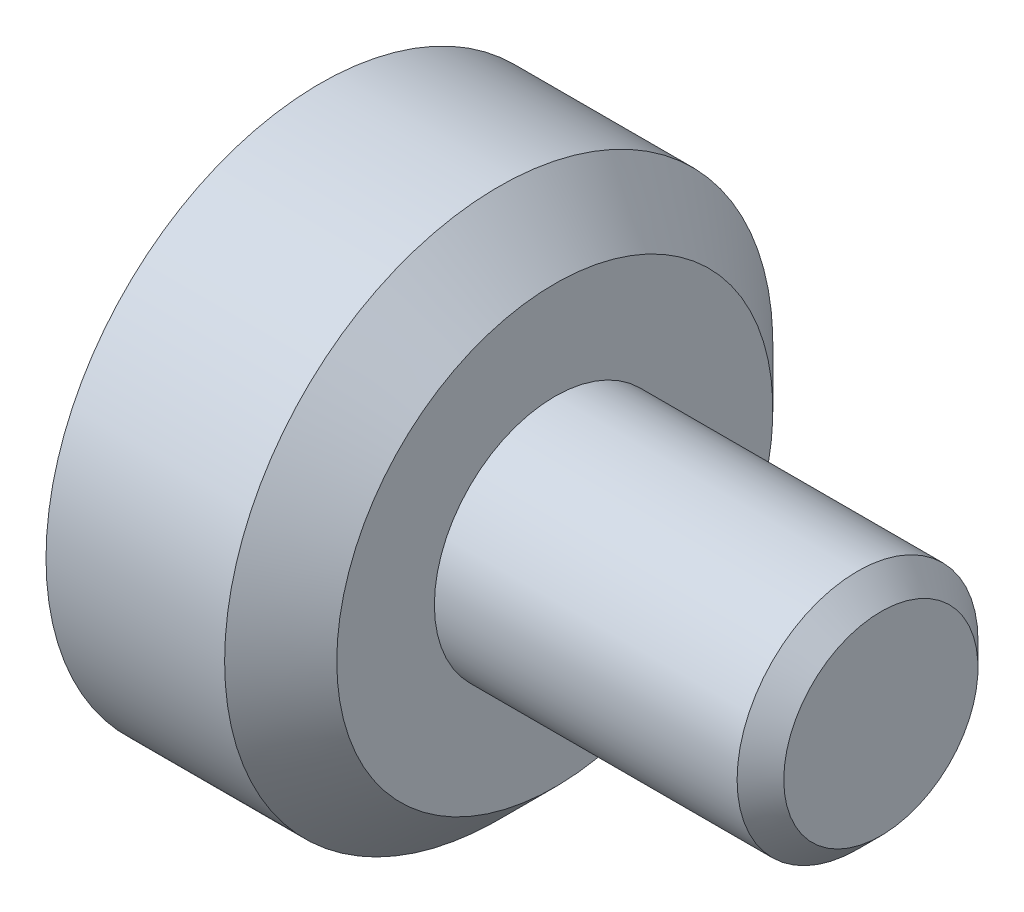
from build123d import *

# Parameters (mm, degrees)
CHANFREIN1_SIZE = 5


with BuildPart() as part:
    # Esquisse1 → R_volution1 (revolve)
    with BuildSketch(Plane.XY, mode=Mode.PRIVATE) as r_volution1_sk:
        Polygon((-42.00625189, 0), (-42.00625189, 58.720054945), (-3.749246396, 58.720054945), (8.261673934, 46.709134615), (8.261673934, 25.801236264), (78.102951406, 25.801236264), (78.102951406, 0), align=None)
    revolve(r_volution1_sk.sketch.rotate(Axis((-54.462021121, 0, 0), (1, 0, 0)), 90), axis=Axis((-54.462021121, 0, 0), (1, 0, 0)))

    # Chanfrein1
    chanfrein1_edges = [part.edges().sort_by_distance(p)[0] for p in [
        (78.102951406, 0, -25.801236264),
    ]]
    chamfer(chanfrein1_edges, length=CHANFREIN1_SIZE)


solid = part.part
